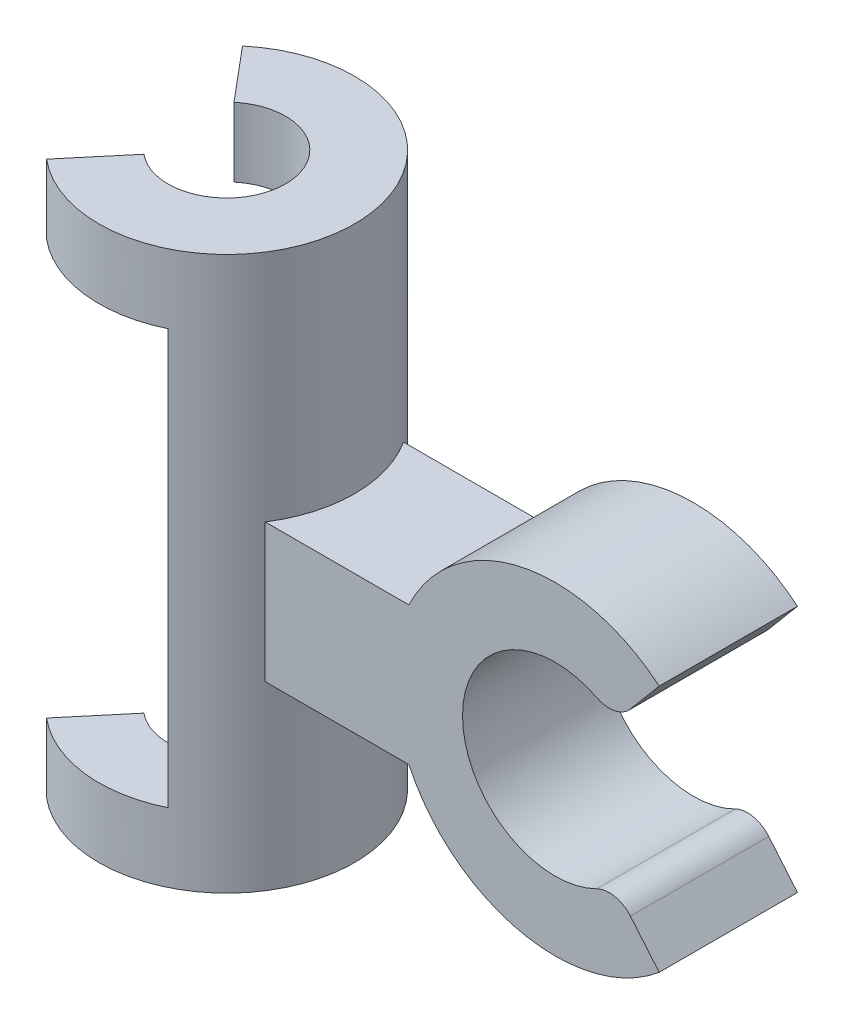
ISO-10303-21;
HEADER;
FILE_DESCRIPTION(('STEP AP214'),'2;1');
FILE_NAME('part.step','',(''),(''),'','','');
FILE_SCHEMA(('AUTOMOTIVE_DESIGN { 1 0 10303 214 1 1 1 1 }'));
ENDSEC;
DATA;
#1=APPLICATION_CONTEXT('core data for automotive mechanical design processes');
#2=APPLICATION_PROTOCOL_DEFINITION('international standard','automotive_design',2000,#1);
#3=PRODUCT_CONTEXT('',#1,'mechanical');
#4=PRODUCT('Part','Part','',(#3));
#5=PRODUCT_RELATED_PRODUCT_CATEGORY('part','',(#4));
#6=PRODUCT_DEFINITION_FORMATION('','',#4);
#7=PRODUCT_DEFINITION_CONTEXT('part definition',#1,'design');
#8=PRODUCT_DEFINITION('design','',#6,#7);
#9=PRODUCT_DEFINITION_SHAPE('','',#8);
#10=(LENGTH_UNIT() NAMED_UNIT(*) SI_UNIT(.MILLI.,.METRE.));
#11=(NAMED_UNIT(*) PLANE_ANGLE_UNIT() SI_UNIT($,.RADIAN.));
#12=(NAMED_UNIT(*) SI_UNIT($,.STERADIAN.) SOLID_ANGLE_UNIT());
#13=UNCERTAINTY_MEASURE_WITH_UNIT(LENGTH_MEASURE(1.E-05),#10,'distance_accuracy_value','');
#14=(GEOMETRIC_REPRESENTATION_CONTEXT(3) GLOBAL_UNCERTAINTY_ASSIGNED_CONTEXT((#13)) GLOBAL_UNIT_ASSIGNED_CONTEXT((#10,
#11,#12)) REPRESENTATION_CONTEXT('',''));
#15=CARTESIAN_POINT('',(0.,0.,0.));
#16=DIRECTION('',(0.,0.,1.));
#17=DIRECTION('',(1.,0.,0.));
#18=AXIS2_PLACEMENT_3D('',#15,#16,#17);
#19=CARTESIAN_POINT('',(0.,0.,0.));
#20=DIRECTION('',(0.,1.,0.));
#21=DIRECTION('',(0.,0.,1.));
#22=AXIS2_PLACEMENT_3D('',#19,#20,#21);
#23=PLANE('',#22);
#24=DIRECTION('',(0.642787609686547,0.,0.766044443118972));
#25=VECTOR('',#24,1.);
#26=CARTESIAN_POINT('',(-2.73184734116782,0.,-3.25568888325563));
#27=LINE('',#26,#25);
#28=CARTESIAN_POINT('',(-5.94578538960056,0.,-7.08591109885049));
#29=VERTEX_POINT('',#28);
#30=CARTESIAN_POINT('',(-2.73184734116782,0.,-3.25568888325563));
#31=VERTEX_POINT('',#30);
#32=EDGE_CURVE('E260',#29,#31,#27,.T.);
#33=ORIENTED_EDGE('',*,*,#32,.F.);
#34=CARTESIAN_POINT('',(0.,0.,0.));
#35=DIRECTION('',(0.,1.,0.));
#36=DIRECTION('',(0.,0.,1.));
#37=AXIS2_PLACEMENT_3D('',#34,#35,#36);
#38=CIRCLE('',#37,9.25);
#39=CARTESIAN_POINT('',(-5.94578538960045,0.,7.08591109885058));
#40=VERTEX_POINT('',#39);
#41=EDGE_CURVE('E263',#40,#29,#38,.T.);
#42=ORIENTED_EDGE('',*,*,#41,.F.);
#43=DIRECTION('',(-0.642787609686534,0.,0.766044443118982));
#44=VECTOR('',#43,1.);
#45=CARTESIAN_POINT('',(-5.94578538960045,0.,7.08591109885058));
#46=LINE('',#45,#44);
#47=CARTESIAN_POINT('',(-2.73184734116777,0.,3.25568888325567));
#48=VERTEX_POINT('',#47);
#49=EDGE_CURVE('E45',#48,#40,#46,.T.);
#50=ORIENTED_EDGE('',*,*,#49,.F.);
#51=CARTESIAN_POINT('',(0.,0.,0.));
#52=DIRECTION('',(0.,1.,0.));
#53=DIRECTION('',(0.,0.,1.));
#54=AXIS2_PLACEMENT_3D('',#51,#52,#53);
#55=CIRCLE('',#54,4.25);
#56=EDGE_CURVE('E11',#31,#48,#55,.F.);
#57=ORIENTED_EDGE('',*,*,#56,.F.);
#58=EDGE_LOOP('',(#33,#42,#50,#57));
#59=FACE_BOUND('',#58,.T.);
#60=ADVANCED_FACE('F38',(#59),#23,.F.);
#61=CARTESIAN_POINT('',(28.75,18.1,5.));
#62=DIRECTION('',(0.,0.,-1.));
#63=DIRECTION('',(-1.,0.,0.));
#64=AXIS2_PLACEMENT_3D('',#61,#62,#63);
#65=CYLINDRICAL_SURFACE('',#64,11.7);
#66=CARTESIAN_POINT('',(28.75,18.1,-5.));
#67=DIRECTION('',(0.,0.,1.));
#68=DIRECTION('',(1.,0.,0.));
#69=AXIS2_PLACEMENT_3D('',#66,#67,#68);
#70=CIRCLE('',#69,11.7);
#71=CARTESIAN_POINT('',(36.2706150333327,27.0627199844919,-5.));
#72=VERTEX_POINT('',#71);
#73=CARTESIAN_POINT('',(18.1721930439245,23.1,-5.));
#74=VERTEX_POINT('',#73);
#75=EDGE_CURVE('E324',#72,#74,#70,.T.);
#76=ORIENTED_EDGE('',*,*,#75,.T.);
#77=DIRECTION('',(0.,0.,-1.));
#78=VECTOR('',#77,1.);
#79=CARTESIAN_POINT('',(18.1721930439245,23.1,5.));
#80=LINE('',#79,#78);
#81=CARTESIAN_POINT('',(18.1721930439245,23.1,5.));
#82=VERTEX_POINT('',#81);
#83=EDGE_CURVE('E319',#82,#74,#80,.T.);
#84=ORIENTED_EDGE('',*,*,#83,.F.);
#85=CARTESIAN_POINT('',(28.75,18.1,5.));
#86=DIRECTION('',(0.,0.,1.));
#87=DIRECTION('',(1.,0.,0.));
#88=AXIS2_PLACEMENT_3D('',#85,#86,#87);
#89=CIRCLE('',#88,11.7);
#90=CARTESIAN_POINT('',(36.2706150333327,27.0627199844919,5.));
#91=VERTEX_POINT('',#90);
#92=EDGE_CURVE('E308',#91,#82,#89,.T.);
#93=ORIENTED_EDGE('',*,*,#92,.F.);
#94=DIRECTION('',(0.,0.,-1.));
#95=VECTOR('',#94,1.);
#96=CARTESIAN_POINT('',(36.2706150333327,27.0627199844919,5.));
#97=LINE('',#96,#95);
#98=EDGE_CURVE('E336',#91,#72,#97,.T.);
#99=ORIENTED_EDGE('',*,*,#98,.T.);
#100=EDGE_LOOP('',(#76,#84,#93,#99));
#101=FACE_BOUND('',#100,.T.);
#102=ADVANCED_FACE('F393',(#101),#65,.T.);
#103=CARTESIAN_POINT('',(7.9586823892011,-6.67812745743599,5.));
#104=DIRECTION('',(0.766044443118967,-0.642787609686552,0.));
#105=DIRECTION('',(0.642787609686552,0.766044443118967,0.));
#106=AXIS2_PLACEMENT_3D('',#103,#104,#105);
#107=PLANE('',#106);
#108=DIRECTION('',(-0.642787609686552,-0.766044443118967,0.));
#109=VECTOR('',#108,1.);
#110=CARTESIAN_POINT('',(7.9586823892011,-6.67812745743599,5.));
#111=LINE('',#110,#109);
#112=CARTESIAN_POINT('',(34.192479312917,24.5860942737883,5.));
#113=VERTEX_POINT('',#112);
#114=EDGE_CURVE('E314',#91,#113,#111,.T.);
#115=ORIENTED_EDGE('',*,*,#114,.T.);
#116=DIRECTION('',(0.,0.,-1.));
#117=VECTOR('',#116,1.);
#118=CARTESIAN_POINT('',(34.192479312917,24.5860942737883,5.));
#119=LINE('',#118,#117);
#120=CARTESIAN_POINT('',(34.192479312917,24.5860942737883,-5.));
#121=VERTEX_POINT('',#120);
#122=EDGE_CURVE('E257',#113,#121,#119,.T.);
#123=ORIENTED_EDGE('',*,*,#122,.T.);
#124=DIRECTION('',(-0.642787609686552,-0.766044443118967,0.));
#125=VECTOR('',#124,1.);
#126=CARTESIAN_POINT('',(7.9586823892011,-6.67812745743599,-5.));
#127=LINE('',#126,#125);
#128=EDGE_CURVE('E330',#72,#121,#127,.T.);
#129=ORIENTED_EDGE('',*,*,#128,.F.);
#130=ORIENTED_EDGE('',*,*,#98,.F.);
#131=EDGE_LOOP('',(#115,#123,#129,#130));
#132=FACE_BOUND('',#131,.T.);
#133=ADVANCED_FACE('F397',(#132),#107,.T.);
#134=CARTESIAN_POINT('',(32.6603904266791,25.8716694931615,5.));
#135=DIRECTION('',(0.,0.,-1.));
#136=DIRECTION('',(-1.,0.,0.));
#137=AXIS2_PLACEMENT_3D('',#134,#135,#136);
#138=CYLINDRICAL_SURFACE('',#137,2.);
#139=CARTESIAN_POINT('',(32.6603904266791,25.8716694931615,5.));
#140=DIRECTION('',(0.,0.,1.));
#141=DIRECTION('',(1.,0.,0.));
#142=AXIS2_PLACEMENT_3D('',#139,#140,#141);
#143=CIRCLE('',#142,2.);
#144=CARTESIAN_POINT('',(31.7614500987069,24.0850788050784,5.));
#145=VERTEX_POINT('',#144);
#146=EDGE_CURVE('E253',#145,#113,#143,.T.);
#147=ORIENTED_EDGE('',*,*,#146,.F.);
#148=DIRECTION('',(0.,0.,-1.));
#149=VECTOR('',#148,1.);
#150=CARTESIAN_POINT('',(31.7614500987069,24.0850788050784,5.));
#151=LINE('',#150,#149);
#152=CARTESIAN_POINT('',(31.7614500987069,24.0850788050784,-5.));
#153=VERTEX_POINT('',#152);
#154=EDGE_CURVE('E242',#153,#145,#151,.F.);
#155=ORIENTED_EDGE('',*,*,#154,.F.);
#156=CARTESIAN_POINT('',(32.6603904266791,25.8716694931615,-5.));
#157=DIRECTION('',(0.,0.,1.));
#158=DIRECTION('',(1.,0.,0.));
#159=AXIS2_PLACEMENT_3D('',#156,#157,#158);
#160=CIRCLE('',#159,2.);
#161=EDGE_CURVE('E247',#121,#153,#160,.F.);
#162=ORIENTED_EDGE('',*,*,#161,.F.);
#163=ORIENTED_EDGE('',*,*,#122,.F.);
#164=EDGE_LOOP('',(#147,#155,#162,#163));
#165=FACE_BOUND('',#164,.T.);
#166=ADVANCED_FACE('F430',(#165),#138,.T.);
#167=CARTESIAN_POINT('',(28.75,18.1,5.));
#168=DIRECTION('',(0.,0.,-1.));
#169=DIRECTION('',(-1.,0.,0.));
#170=AXIS2_PLACEMENT_3D('',#167,#168,#169);
#171=CYLINDRICAL_SURFACE('',#170,6.7);
#172=CARTESIAN_POINT('',(28.75,18.1,5.));
#173=DIRECTION('',(0.,0.,1.));
#174=DIRECTION('',(1.,0.,0.));
#175=AXIS2_PLACEMENT_3D('',#172,#173,#174);
#176=CIRCLE('',#175,6.7);
#177=CARTESIAN_POINT('',(31.7614500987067,12.1149211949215,5.));
#178=VERTEX_POINT('',#177);
#179=EDGE_CURVE('E311',#145,#178,#176,.T.);
#180=ORIENTED_EDGE('',*,*,#179,.T.);
#181=DIRECTION('',(0.,0.,-1.));
#182=VECTOR('',#181,1.);
#183=CARTESIAN_POINT('',(31.7614500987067,12.1149211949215,5.));
#184=LINE('',#183,#182);
#185=CARTESIAN_POINT('',(31.7614500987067,12.1149211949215,-5.));
#186=VERTEX_POINT('',#185);
#187=EDGE_CURVE('E244',#178,#186,#184,.T.);
#188=ORIENTED_EDGE('',*,*,#187,.T.);
#189=CARTESIAN_POINT('',(28.75,18.1,-5.));
#190=DIRECTION('',(0.,0.,1.));
#191=DIRECTION('',(1.,0.,0.));
#192=AXIS2_PLACEMENT_3D('',#189,#190,#191);
#193=CIRCLE('',#192,6.7);
#194=EDGE_CURVE('E327',#153,#186,#193,.T.);
#195=ORIENTED_EDGE('',*,*,#194,.F.);
#196=ORIENTED_EDGE('',*,*,#154,.T.);
#197=EDGE_LOOP('',(#180,#188,#195,#196));
#198=FACE_BOUND('',#197,.T.);
#199=ADVANCED_FACE('F427',(#198),#171,.F.);
#200=CARTESIAN_POINT('',(32.6603904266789,10.3283305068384,5.));
#201=DIRECTION('',(0.,0.,-1.));
#202=DIRECTION('',(-1.,0.,0.));
#203=AXIS2_PLACEMENT_3D('',#200,#201,#202);
#204=CYLINDRICAL_SURFACE('',#203,2.);
#205=CARTESIAN_POINT('',(32.6603904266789,10.3283305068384,5.));
#206=DIRECTION('',(0.,0.,1.));
#207=DIRECTION('',(1.,0.,0.));
#208=AXIS2_PLACEMENT_3D('',#205,#206,#207);
#209=CIRCLE('',#208,2.);
#210=CARTESIAN_POINT('',(34.1924793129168,11.6139057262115,5.));
#211=VERTEX_POINT('',#210);
#212=EDGE_CURVE('E255',#211,#178,#209,.T.);
#213=ORIENTED_EDGE('',*,*,#212,.F.);
#214=DIRECTION('',(0.,0.,1.));
#215=VECTOR('',#214,1.);
#216=CARTESIAN_POINT('',(34.1924793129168,11.6139057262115,5.));
#217=LINE('',#216,#215);
#218=CARTESIAN_POINT('',(34.1924793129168,11.6139057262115,-5.));
#219=VERTEX_POINT('',#218);
#220=EDGE_CURVE('E251',#219,#211,#217,.T.);
#221=ORIENTED_EDGE('',*,*,#220,.F.);
#222=CARTESIAN_POINT('',(32.6603904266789,10.3283305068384,-5.));
#223=DIRECTION('',(0.,0.,1.));
#224=DIRECTION('',(1.,0.,0.));
#225=AXIS2_PLACEMENT_3D('',#222,#223,#224);
#226=CIRCLE('',#225,2.);
#227=EDGE_CURVE('E249',#186,#219,#226,.F.);
#228=ORIENTED_EDGE('',*,*,#227,.F.);
#229=ORIENTED_EDGE('',*,*,#187,.F.);
#230=EDGE_LOOP('',(#213,#221,#228,#229));
#231=FACE_BOUND('',#230,.T.);
#232=ADVANCED_FACE('F425',(#231),#204,.T.);
#233=CARTESIAN_POINT('',(25.7837027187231,21.6350954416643,5.));
#234=DIRECTION('',(-0.766044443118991,-0.642787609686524,0.));
#235=DIRECTION('',(0.642787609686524,-0.766044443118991,0.));
#236=AXIS2_PLACEMENT_3D('',#233,#234,#235);
#237=PLANE('',#236);
#238=DIRECTION('',(-0.642787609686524,0.766044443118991,0.));
#239=VECTOR('',#238,1.);
#240=CARTESIAN_POINT('',(25.7837027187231,21.6350954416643,-5.));
#241=LINE('',#240,#239);
#242=CARTESIAN_POINT('',(36.2706150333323,9.13728001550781,-5.));
#243=VERTEX_POINT('',#242);
#244=EDGE_CURVE('E323',#243,#219,#241,.T.);
#245=ORIENTED_EDGE('',*,*,#244,.T.);
#246=ORIENTED_EDGE('',*,*,#220,.T.);
#247=DIRECTION('',(-0.642787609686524,0.766044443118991,0.));
#248=VECTOR('',#247,1.);
#249=CARTESIAN_POINT('',(25.7837027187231,21.6350954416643,5.));
#250=LINE('',#249,#248);
#251=CARTESIAN_POINT('',(36.2706150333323,9.13728001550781,5.));
#252=VERTEX_POINT('',#251);
#253=EDGE_CURVE('E307',#252,#211,#250,.T.);
#254=ORIENTED_EDGE('',*,*,#253,.F.);
#255=DIRECTION('',(0.,0.,-1.));
#256=VECTOR('',#255,1.);
#257=CARTESIAN_POINT('',(36.2706150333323,9.13728001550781,5.));
#258=LINE('',#257,#256);
#259=EDGE_CURVE('E338',#252,#243,#258,.T.);
#260=ORIENTED_EDGE('',*,*,#259,.T.);
#261=EDGE_LOOP('',(#245,#246,#254,#260));
#262=FACE_BOUND('',#261,.T.);
#263=ADVANCED_FACE('F422',(#262),#237,.F.);
#264=CARTESIAN_POINT('',(18.1721930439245,13.1,-5.));
#265=VERTEX_POINT('',#264);
#266=EDGE_CURVE('E321',#265,#243,#70,.T.);
#267=ORIENTED_EDGE('',*,*,#266,.T.);
#268=ORIENTED_EDGE('',*,*,#259,.F.);
#269=CARTESIAN_POINT('',(18.1721930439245,13.1,5.));
#270=VERTEX_POINT('',#269);
#271=EDGE_CURVE('E304',#270,#252,#89,.T.);
#272=ORIENTED_EDGE('',*,*,#271,.F.);
#273=DIRECTION('',(0.,0.,-1.));
#274=VECTOR('',#273,1.);
#275=CARTESIAN_POINT('',(18.1721930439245,13.1,5.));
#276=LINE('',#275,#274);
#277=EDGE_CURVE('E341',#270,#265,#276,.T.);
#278=ORIENTED_EDGE('',*,*,#277,.T.);
#279=EDGE_LOOP('',(#267,#268,#272,#278));
#280=FACE_BOUND('',#279,.T.);
#281=ADVANCED_FACE('F400',(#280),#65,.T.);
#282=CARTESIAN_POINT('',(0.,5.,-9.25));
#283=DIRECTION('',(0.,1.,0.));
#284=DIRECTION('',(0.,0.,1.));
#285=AXIS2_PLACEMENT_3D('',#282,#283,#284);
#286=PLANE('',#285);
#287=CARTESIAN_POINT('',(0.,5.,0.));
#288=DIRECTION('',(0.,1.,0.));
#289=DIRECTION('',(0.,0.,1.));
#290=AXIS2_PLACEMENT_3D('',#287,#288,#289);
#291=CIRCLE('',#290,4.25);
#292=CARTESIAN_POINT('',(4.05421461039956,5.,1.27508583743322));
#293=VERTEX_POINT('',#292);
#294=CARTESIAN_POINT('',(-2.73184734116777,5.,3.25568888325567));
#295=VERTEX_POINT('',#294);
#296=EDGE_CURVE('E199',#293,#295,#291,.F.);
#297=ORIENTED_EDGE('',*,*,#296,.T.);
#298=DIRECTION('',(-0.642787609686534,0.,0.766044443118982));
#299=VECTOR('',#298,1.);
#300=CARTESIAN_POINT('',(-5.94578538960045,5.,7.08591109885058));
#301=LINE('',#300,#299);
#302=CARTESIAN_POINT('',(-5.94578538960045,5.,7.08591109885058));
#303=VERTEX_POINT('',#302);
#304=EDGE_CURVE('E284',#295,#303,#301,.T.);
#305=ORIENTED_EDGE('',*,*,#304,.T.);
#306=CARTESIAN_POINT('',(0.,5.,0.));
#307=DIRECTION('',(0.,1.,0.));
#308=DIRECTION('',(0.,0.,1.));
#309=AXIS2_PLACEMENT_3D('',#306,#307,#308);
#310=CIRCLE('',#309,9.25);
#311=CARTESIAN_POINT('',(4.05421461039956,5.,8.31419532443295));
#312=VERTEX_POINT('',#311);
#313=EDGE_CURVE('E282',#303,#312,#310,.T.);
#314=ORIENTED_EDGE('',*,*,#313,.T.);
#315=DIRECTION('',(0.,0.,1.));
#316=VECTOR('',#315,1.);
#317=CARTESIAN_POINT('',(4.05421461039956,5.,-9.25));
#318=LINE('',#317,#316);
#319=EDGE_CURVE('E370',#293,#312,#318,.T.);
#320=ORIENTED_EDGE('',*,*,#319,.F.);
#321=EDGE_LOOP('',(#297,#305,#314,#320));
#322=FACE_BOUND('',#321,.T.);
#323=ADVANCED_FACE('F374',(#322),#286,.T.);
#324=CARTESIAN_POINT('',(4.05421461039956,0.,-9.25));
#325=DIRECTION('',(-1.,0.,0.));
#326=DIRECTION('',(0.,-1.,0.));
#327=AXIS2_PLACEMENT_3D('',#324,#325,#326);
#328=PLANE('',#327);
#329=DIRECTION('',(0.,-1.,0.));
#330=VECTOR('',#329,1.);
#331=CARTESIAN_POINT('',(4.05421461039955,40.,1.27508583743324));
#332=LINE('',#331,#330);
#333=CARTESIAN_POINT('',(4.05421461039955,35.,1.27508583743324));
#334=VERTEX_POINT('',#333);
#335=EDGE_CURVE('E298',#334,#293,#332,.T.);
#336=ORIENTED_EDGE('',*,*,#335,.T.);
#337=ORIENTED_EDGE('',*,*,#319,.T.);
#338=DIRECTION('',(0.,-1.,0.));
#339=VECTOR('',#338,1.);
#340=CARTESIAN_POINT('',(4.05421461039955,40.,8.31419532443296));
#341=LINE('',#340,#339);
#342=CARTESIAN_POINT('',(4.05421461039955,35.,8.31419532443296));
#343=VERTEX_POINT('',#342);
#344=EDGE_CURVE('E209',#312,#343,#341,.F.);
#345=ORIENTED_EDGE('',*,*,#344,.T.);
#346=DIRECTION('',(0.,0.,1.));
#347=VECTOR('',#346,1.);
#348=CARTESIAN_POINT('',(4.05421461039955,35.,-9.25));
#349=LINE('',#348,#347);
#350=EDGE_CURVE('E365',#334,#343,#349,.T.);
#351=ORIENTED_EDGE('',*,*,#350,.F.);
#352=EDGE_LOOP('',(#336,#337,#345,#351));
#353=FACE_BOUND('',#352,.T.);
#354=ADVANCED_FACE('F373',(#353),#328,.T.);
#355=CARTESIAN_POINT('',(0.,35.,-9.25));
#356=DIRECTION('',(0.,-1.,0.));
#357=DIRECTION('',(0.,0.,-1.));
#358=AXIS2_PLACEMENT_3D('',#355,#356,#357);
#359=PLANE('',#358);
#360=CARTESIAN_POINT('',(0.,35.,0.));
#361=DIRECTION('',(0.,-1.,0.));
#362=DIRECTION('',(0.,0.,-1.));
#363=AXIS2_PLACEMENT_3D('',#360,#361,#362);
#364=CIRCLE('',#363,4.25);
#365=CARTESIAN_POINT('',(-2.73184734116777,35.,3.25568888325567));
#366=VERTEX_POINT('',#365);
#367=EDGE_CURVE('E296',#366,#334,#364,.F.);
#368=ORIENTED_EDGE('',*,*,#367,.T.);
#369=ORIENTED_EDGE('',*,*,#350,.T.);
#370=CARTESIAN_POINT('',(0.,35.,0.));
#371=DIRECTION('',(0.,-1.,0.));
#372=DIRECTION('',(0.,0.,-1.));
#373=AXIS2_PLACEMENT_3D('',#370,#371,#372);
#374=CIRCLE('',#373,9.25);
#375=CARTESIAN_POINT('',(-5.94578538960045,35.,7.08591109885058));
#376=VERTEX_POINT('',#375);
#377=EDGE_CURVE('E201',#343,#376,#374,.T.);
#378=ORIENTED_EDGE('',*,*,#377,.T.);
#379=DIRECTION('',(0.642787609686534,0.,-0.766044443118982));
#380=VECTOR('',#379,1.);
#381=CARTESIAN_POINT('',(-5.94578538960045,35.,7.08591109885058));
#382=LINE('',#381,#380);
#383=EDGE_CURVE('E294',#376,#366,#382,.T.);
#384=ORIENTED_EDGE('',*,*,#383,.T.);
#385=EDGE_LOOP('',(#368,#369,#378,#384));
#386=FACE_BOUND('',#385,.T.);
#387=ADVANCED_FACE('F363',(#386),#359,.T.);
#388=CARTESIAN_POINT('',(-5.94578538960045,40.,7.08591109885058));
#389=DIRECTION('',(0.766044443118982,0.,0.642787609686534));
#390=DIRECTION('',(0.642787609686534,0.,-0.766044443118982));
#391=AXIS2_PLACEMENT_3D('',#388,#389,#390);
#392=PLANE('',#391);
#393=ORIENTED_EDGE('',*,*,#383,.F.);
#394=DIRECTION('',(0.,-1.,0.));
#395=VECTOR('',#394,1.);
#396=CARTESIAN_POINT('',(-5.94578538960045,40.,7.08591109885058));
#397=LINE('',#396,#395);
#398=CARTESIAN_POINT('',(-5.94578538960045,40.,7.08591109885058));
#399=VERTEX_POINT('',#398);
#400=EDGE_CURVE('E217',#399,#376,#397,.T.);
#401=ORIENTED_EDGE('',*,*,#400,.F.);
#402=DIRECTION('',(-0.642787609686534,0.,0.766044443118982));
#403=VECTOR('',#402,1.);
#404=CARTESIAN_POINT('',(-5.94578538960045,40.,7.08591109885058));
#405=LINE('',#404,#403);
#406=CARTESIAN_POINT('',(-2.73184734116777,40.,3.25568888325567));
#407=VERTEX_POINT('',#406);
#408=EDGE_CURVE('E347',#407,#399,#405,.T.);
#409=ORIENTED_EDGE('',*,*,#408,.F.);
#410=DIRECTION('',(0.,-1.,0.));
#411=VECTOR('',#410,1.);
#412=CARTESIAN_POINT('',(-2.73184734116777,40.,3.25568888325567));
#413=LINE('',#412,#411);
#414=EDGE_CURVE('E226',#407,#366,#413,.T.);
#415=ORIENTED_EDGE('',*,*,#414,.T.);
#416=EDGE_LOOP('',(#393,#401,#409,#415));
#417=FACE_BOUND('',#416,.T.);
#418=ADVANCED_FACE('F358',(#417),#392,.F.);
#419=CARTESIAN_POINT('',(0.,40.,0.));
#420=DIRECTION('',(0.,1.,0.));
#421=DIRECTION('',(0.,0.,1.));
#422=AXIS2_PLACEMENT_3D('',#419,#420,#421);
#423=PLANE('',#422);
#424=CARTESIAN_POINT('',(0.,40.,0.));
#425=DIRECTION('',(0.,-1.,0.));
#426=DIRECTION('',(0.,0.,1.));
#427=AXIS2_PLACEMENT_3D('',#424,#425,#426);
#428=CIRCLE('',#427,4.25);
#429=CARTESIAN_POINT('',(-2.73184734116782,40.,-3.25568888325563));
#430=VERTEX_POINT('',#429);
#431=EDGE_CURVE('E344',#430,#407,#428,.T.);
#432=ORIENTED_EDGE('',*,*,#431,.T.);
#433=ORIENTED_EDGE('',*,*,#408,.T.);
#434=CARTESIAN_POINT('',(0.,40.,0.));
#435=DIRECTION('',(0.,1.,0.));
#436=DIRECTION('',(0.,0.,1.));
#437=AXIS2_PLACEMENT_3D('',#434,#435,#436);
#438=CIRCLE('',#437,9.25);
#439=CARTESIAN_POINT('',(-5.94578538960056,40.,-7.08591109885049));
#440=VERTEX_POINT('',#439);
#441=EDGE_CURVE('E349',#399,#440,#438,.T.);
#442=ORIENTED_EDGE('',*,*,#441,.T.);
#443=DIRECTION('',(0.642787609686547,0.,0.766044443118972));
#444=VECTOR('',#443,1.);
#445=CARTESIAN_POINT('',(-2.73184734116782,40.,-3.25568888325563));
#446=LINE('',#445,#444);
#447=EDGE_CURVE('E213',#440,#430,#446,.T.);
#448=ORIENTED_EDGE('',*,*,#447,.T.);
#449=EDGE_LOOP('',(#432,#433,#442,#448));
#450=FACE_BOUND('',#449,.T.);
#451=ADVANCED_FACE('F354',(#450),#423,.T.);
#452=CARTESIAN_POINT('',(-2.73184734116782,40.,-3.25568888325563));
#453=DIRECTION('',(0.766044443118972,0.,-0.642787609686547));
#454=DIRECTION('',(-0.642787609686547,0.,-0.766044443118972));
#455=AXIS2_PLACEMENT_3D('',#452,#453,#454);
#456=PLANE('',#455);
#457=DIRECTION('',(-0.642787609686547,0.,-0.766044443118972));
#458=VECTOR('',#457,1.);
#459=CARTESIAN_POINT('',(-2.73184734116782,35.,-3.25568888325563));
#460=LINE('',#459,#458);
#461=CARTESIAN_POINT('',(-2.73184734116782,35.,-3.25568888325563));
#462=VERTEX_POINT('',#461);
#463=CARTESIAN_POINT('',(-5.94578538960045,35.,-7.08591109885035));
#464=VERTEX_POINT('',#463);
#465=EDGE_CURVE('E203',#462,#464,#460,.T.);
#466=ORIENTED_EDGE('',*,*,#465,.F.);
#467=DIRECTION('',(0.,-1.,0.));
#468=VECTOR('',#467,1.);
#469=CARTESIAN_POINT('',(-2.73184734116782,40.,-3.25568888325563));
#470=LINE('',#469,#468);
#471=EDGE_CURVE('E220',#430,#462,#470,.T.);
#472=ORIENTED_EDGE('',*,*,#471,.F.);
#473=ORIENTED_EDGE('',*,*,#447,.F.);
#474=DIRECTION('',(0.,-1.,0.));
#475=VECTOR('',#474,1.);
#476=CARTESIAN_POINT('',(-5.94578538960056,40.,-7.08591109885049));
#477=LINE('',#476,#475);
#478=EDGE_CURVE('E191',#440,#464,#477,.T.);
#479=ORIENTED_EDGE('',*,*,#478,.T.);
#480=EDGE_LOOP('',(#466,#472,#473,#479));
#481=FACE_BOUND('',#480,.T.);
#482=ADVANCED_FACE('F212',(#481),#456,.F.);
#483=CARTESIAN_POINT('',(4.05421461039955,35.,-1.27508583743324));
#484=VERTEX_POINT('',#483);
#485=EDGE_CURVE('E198',#484,#462,#364,.F.);
#486=ORIENTED_EDGE('',*,*,#485,.T.);
#487=ORIENTED_EDGE('',*,*,#465,.T.);
#488=CARTESIAN_POINT('',(4.05421461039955,35.,-8.31419532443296));
#489=VERTEX_POINT('',#488);
#490=EDGE_CURVE('E185',#464,#489,#374,.T.);
#491=ORIENTED_EDGE('',*,*,#490,.T.);
#492=EDGE_CURVE('E286',#489,#484,#349,.T.);
#493=ORIENTED_EDGE('',*,*,#492,.T.);
#494=EDGE_LOOP('',(#486,#487,#491,#493));
#495=FACE_BOUND('',#494,.T.);
#496=ADVANCED_FACE('F204',(#495),#359,.T.);
#497=DIRECTION('',(0.,-1.,0.));
#498=VECTOR('',#497,1.);
#499=CARTESIAN_POINT('',(4.05421461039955,40.,-1.27508583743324));
#500=LINE('',#499,#498);
#501=CARTESIAN_POINT('',(4.05421461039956,5.,-1.27508583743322));
#502=VERTEX_POINT('',#501);
#503=EDGE_CURVE('E281',#502,#484,#500,.F.);
#504=ORIENTED_EDGE('',*,*,#503,.T.);
#505=ORIENTED_EDGE('',*,*,#492,.F.);
#506=DIRECTION('',(0.,-1.,0.));
#507=VECTOR('',#506,1.);
#508=CARTESIAN_POINT('',(4.05421461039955,40.,-8.31419532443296));
#509=LINE('',#508,#507);
#510=CARTESIAN_POINT('',(4.05421461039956,5.,-8.31419532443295));
#511=VERTEX_POINT('',#510);
#512=EDGE_CURVE('E194',#489,#511,#509,.T.);
#513=ORIENTED_EDGE('',*,*,#512,.T.);
#514=EDGE_CURVE('E368',#511,#502,#318,.T.);
#515=ORIENTED_EDGE('',*,*,#514,.T.);
#516=EDGE_LOOP('',(#504,#505,#513,#515));
#517=FACE_BOUND('',#516,.T.);
#518=ADVANCED_FACE('F378',(#517),#328,.T.);
#519=EDGE_CURVE('E225',#295,#48,#413,.T.);
#520=ORIENTED_EDGE('',*,*,#519,.T.);
#521=ORIENTED_EDGE('',*,*,#49,.T.);
#522=EDGE_CURVE('E214',#303,#40,#397,.T.);
#523=ORIENTED_EDGE('',*,*,#522,.F.);
#524=ORIENTED_EDGE('',*,*,#304,.F.);
#525=EDGE_LOOP('',(#520,#521,#523,#524));
#526=FACE_BOUND('',#525,.T.);
#527=ADVANCED_FACE('F375',(#526),#392,.F.);
#528=CARTESIAN_POINT('',(0.,0.,-5.));
#529=DIRECTION('',(0.,0.,1.));
#530=DIRECTION('',(1.,0.,0.));
#531=AXIS2_PLACEMENT_3D('',#528,#529,#530);
#532=PLANE('',#531);
#533=ORIENTED_EDGE('',*,*,#194,.T.);
#534=ORIENTED_EDGE('',*,*,#227,.T.);
#535=ORIENTED_EDGE('',*,*,#244,.F.);
#536=ORIENTED_EDGE('',*,*,#266,.F.);
#537=DIRECTION('',(1.,0.,0.));
#538=VECTOR('',#537,1.);
#539=CARTESIAN_POINT('',(0.,13.1,-5.));
#540=LINE('',#539,#538);
#541=CARTESIAN_POINT('',(7.78219120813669,13.1,-5.));
#542=VERTEX_POINT('',#541);
#543=EDGE_CURVE('E301',#542,#265,#540,.T.);
#544=ORIENTED_EDGE('',*,*,#543,.F.);
#545=DIRECTION('',(0.,-1.,0.));
#546=VECTOR('',#545,1.);
#547=CARTESIAN_POINT('',(7.78219120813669,40.,-5.));
#548=LINE('',#547,#546);
#549=CARTESIAN_POINT('',(7.78219120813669,23.1,-5.));
#550=VERTEX_POINT('',#549);
#551=EDGE_CURVE('E229',#542,#550,#548,.F.);
#552=ORIENTED_EDGE('',*,*,#551,.T.);
#553=DIRECTION('',(1.,0.,0.));
#554=VECTOR('',#553,1.);
#555=CARTESIAN_POINT('',(0.,23.1,-5.));
#556=LINE('',#555,#554);
#557=EDGE_CURVE('E305',#550,#74,#556,.T.);
#558=ORIENTED_EDGE('',*,*,#557,.T.);
#559=ORIENTED_EDGE('',*,*,#75,.F.);
#560=ORIENTED_EDGE('',*,*,#128,.T.);
#561=ORIENTED_EDGE('',*,*,#161,.T.);
#562=EDGE_LOOP('',(#533,#534,#535,#536,#544,#552,#558,#559,#560,#561));
#563=FACE_BOUND('',#562,.T.);
#564=ADVANCED_FACE('F377',(#563),#532,.F.);
#565=CARTESIAN_POINT('',(0.,23.1,5.));
#566=DIRECTION('',(0.,1.,0.));
#567=DIRECTION('',(-1.,0.,0.));
#568=AXIS2_PLACEMENT_3D('',#565,#566,#567);
#569=PLANE('',#568);
#570=CARTESIAN_POINT('',(0.,23.1,0.));
#571=DIRECTION('',(0.,1.,0.));
#572=DIRECTION('',(-1.,0.,0.));
#573=AXIS2_PLACEMENT_3D('',#570,#571,#572);
#574=CIRCLE('',#573,9.25);
#575=CARTESIAN_POINT('',(7.78219120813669,23.1,5.));
#576=VERTEX_POINT('',#575);
#577=EDGE_CURVE('E232',#576,#550,#574,.T.);
#578=ORIENTED_EDGE('',*,*,#577,.F.);
#579=DIRECTION('',(1.,0.,0.));
#580=VECTOR('',#579,1.);
#581=CARTESIAN_POINT('',(0.,23.1,5.));
#582=LINE('',#581,#580);
#583=EDGE_CURVE('E317',#576,#82,#582,.T.);
#584=ORIENTED_EDGE('',*,*,#583,.T.);
#585=ORIENTED_EDGE('',*,*,#83,.T.);
#586=ORIENTED_EDGE('',*,*,#557,.F.);
#587=EDGE_LOOP('',(#578,#584,#585,#586));
#588=FACE_BOUND('',#587,.T.);
#589=ADVANCED_FACE('F384',(#588),#569,.T.);
#590=CARTESIAN_POINT('',(0.,0.,5.));
#591=DIRECTION('',(0.,0.,1.));
#592=DIRECTION('',(1.,0.,0.));
#593=AXIS2_PLACEMENT_3D('',#590,#591,#592);
#594=PLANE('',#593);
#595=ORIENTED_EDGE('',*,*,#253,.T.);
#596=ORIENTED_EDGE('',*,*,#212,.T.);
#597=ORIENTED_EDGE('',*,*,#179,.F.);
#598=ORIENTED_EDGE('',*,*,#146,.T.);
#599=ORIENTED_EDGE('',*,*,#114,.F.);
#600=ORIENTED_EDGE('',*,*,#92,.T.);
#601=ORIENTED_EDGE('',*,*,#583,.F.);
#602=DIRECTION('',(0.,-1.,0.));
#603=VECTOR('',#602,1.);
#604=CARTESIAN_POINT('',(7.78219120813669,40.,5.));
#605=LINE('',#604,#603);
#606=CARTESIAN_POINT('',(7.78219120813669,13.1,5.));
#607=VERTEX_POINT('',#606);
#608=EDGE_CURVE('E237',#607,#576,#605,.F.);
#609=ORIENTED_EDGE('',*,*,#608,.F.);
#610=DIRECTION('',(1.,0.,0.));
#611=VECTOR('',#610,1.);
#612=CARTESIAN_POINT('',(0.,13.1,5.));
#613=LINE('',#612,#611);
#614=EDGE_CURVE('E302',#607,#270,#613,.T.);
#615=ORIENTED_EDGE('',*,*,#614,.T.);
#616=ORIENTED_EDGE('',*,*,#271,.T.);
#617=EDGE_LOOP('',(#595,#596,#597,#598,#599,#600,#601,#609,#615,#616));
#618=FACE_BOUND('',#617,.T.);
#619=ADVANCED_FACE('F420',(#618),#594,.T.);
#620=CARTESIAN_POINT('',(0.,13.1,5.));
#621=DIRECTION('',(0.,1.,0.));
#622=DIRECTION('',(-1.,0.,0.));
#623=AXIS2_PLACEMENT_3D('',#620,#621,#622);
#624=PLANE('',#623);
#625=ORIENTED_EDGE('',*,*,#614,.F.);
#626=CARTESIAN_POINT('',(0.,13.1,0.));
#627=DIRECTION('',(0.,1.,0.));
#628=DIRECTION('',(-1.,0.,0.));
#629=AXIS2_PLACEMENT_3D('',#626,#627,#628);
#630=CIRCLE('',#629,9.25);
#631=EDGE_CURVE('E234',#607,#542,#630,.T.);
#632=ORIENTED_EDGE('',*,*,#631,.T.);
#633=ORIENTED_EDGE('',*,*,#543,.T.);
#634=ORIENTED_EDGE('',*,*,#277,.F.);
#635=EDGE_LOOP('',(#625,#632,#633,#634));
#636=FACE_BOUND('',#635,.T.);
#637=ADVANCED_FACE('F417',(#636),#624,.F.);
#638=CARTESIAN_POINT('',(-2.73184734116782,5.,-3.25568888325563));
#639=VERTEX_POINT('',#638);
#640=EDGE_CURVE('E276',#639,#502,#291,.F.);
#641=ORIENTED_EDGE('',*,*,#640,.T.);
#642=ORIENTED_EDGE('',*,*,#514,.F.);
#643=CARTESIAN_POINT('',(-5.94578538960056,5.,-7.08591109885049));
#644=VERTEX_POINT('',#643);
#645=EDGE_CURVE('E278',#511,#644,#310,.T.);
#646=ORIENTED_EDGE('',*,*,#645,.T.);
#647=DIRECTION('',(0.642787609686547,0.,0.766044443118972));
#648=VECTOR('',#647,1.);
#649=CARTESIAN_POINT('',(-2.73184734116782,5.,-3.25568888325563));
#650=LINE('',#649,#648);
#651=EDGE_CURVE('E210',#644,#639,#650,.T.);
#652=ORIENTED_EDGE('',*,*,#651,.T.);
#653=EDGE_LOOP('',(#641,#642,#646,#652));
#654=FACE_BOUND('',#653,.T.);
#655=ADVANCED_FACE('F274',(#654),#286,.T.);
#656=CARTESIAN_POINT('',(0.,40.,0.));
#657=DIRECTION('',(0.,-1.,0.));
#658=DIRECTION('',(0.,0.,-1.));
#659=AXIS2_PLACEMENT_3D('',#656,#657,#658);
#660=CYLINDRICAL_SURFACE('',#659,4.25);
#661=EDGE_CURVE('E271',#639,#31,#470,.T.);
#662=ORIENTED_EDGE('',*,*,#661,.T.);
#663=ORIENTED_EDGE('',*,*,#56,.T.);
#664=ORIENTED_EDGE('',*,*,#519,.F.);
#665=ORIENTED_EDGE('',*,*,#296,.F.);
#666=ORIENTED_EDGE('',*,*,#335,.F.);
#667=ORIENTED_EDGE('',*,*,#367,.F.);
#668=ORIENTED_EDGE('',*,*,#414,.F.);
#669=ORIENTED_EDGE('',*,*,#431,.F.);
#670=ORIENTED_EDGE('',*,*,#471,.T.);
#671=ORIENTED_EDGE('',*,*,#485,.F.);
#672=ORIENTED_EDGE('',*,*,#503,.F.);
#673=ORIENTED_EDGE('',*,*,#640,.F.);
#674=EDGE_LOOP('',(#662,#663,#664,#665,#666,#667,#668,#669,#670,#671,#672,#673));
#675=FACE_BOUND('',#674,.T.);
#676=ADVANCED_FACE('F280',(#675),#660,.F.);
#677=CARTESIAN_POINT('',(0.,40.,0.));
#678=DIRECTION('',(0.,-1.,0.));
#679=DIRECTION('',(0.,0.,-1.));
#680=AXIS2_PLACEMENT_3D('',#677,#678,#679);
#681=CYLINDRICAL_SURFACE('',#680,9.25);
#682=ORIENTED_EDGE('',*,*,#631,.F.);
#683=ORIENTED_EDGE('',*,*,#608,.T.);
#684=ORIENTED_EDGE('',*,*,#577,.T.);
#685=ORIENTED_EDGE('',*,*,#551,.F.);
#686=EDGE_LOOP('',(#682,#683,#684,#685));
#687=FACE_BOUND('',#686,.T.);
#688=ORIENTED_EDGE('',*,*,#522,.T.);
#689=ORIENTED_EDGE('',*,*,#41,.T.);
#690=EDGE_CURVE('E215',#644,#29,#477,.T.);
#691=ORIENTED_EDGE('',*,*,#690,.F.);
#692=ORIENTED_EDGE('',*,*,#645,.F.);
#693=ORIENTED_EDGE('',*,*,#512,.F.);
#694=ORIENTED_EDGE('',*,*,#490,.F.);
#695=ORIENTED_EDGE('',*,*,#478,.F.);
#696=ORIENTED_EDGE('',*,*,#441,.F.);
#697=ORIENTED_EDGE('',*,*,#400,.T.);
#698=ORIENTED_EDGE('',*,*,#377,.F.);
#699=ORIENTED_EDGE('',*,*,#344,.F.);
#700=ORIENTED_EDGE('',*,*,#313,.F.);
#701=EDGE_LOOP('',(#688,#689,#691,#692,#693,#694,#695,#696,#697,#698,#699,#700));
#702=FACE_BOUND('',#701,.T.);
#703=ADVANCED_FACE('F188',(#687,#702),#681,.T.);
#704=ORIENTED_EDGE('',*,*,#690,.T.);
#705=ORIENTED_EDGE('',*,*,#32,.T.);
#706=ORIENTED_EDGE('',*,*,#661,.F.);
#707=ORIENTED_EDGE('',*,*,#651,.F.);
#708=EDGE_LOOP('',(#704,#705,#706,#707));
#709=FACE_BOUND('',#708,.T.);
#710=ADVANCED_FACE('F270',(#709),#456,.F.);
#711=CLOSED_SHELL('',(#60,#102,#133,#166,#199,#232,#263,#281,#323,#354,#387,#418,#451,#482,#496,
#518,#527,#564,#589,#619,#637,#655,#676,#703,#710));
#712=MANIFOLD_SOLID_BREP('B2',#711);
#713=ADVANCED_BREP_SHAPE_REPRESENTATION('',(#18,#712),#14);
#714=SHAPE_DEFINITION_REPRESENTATION(#9,#713);
ENDSEC;
END-ISO-10303-21;
